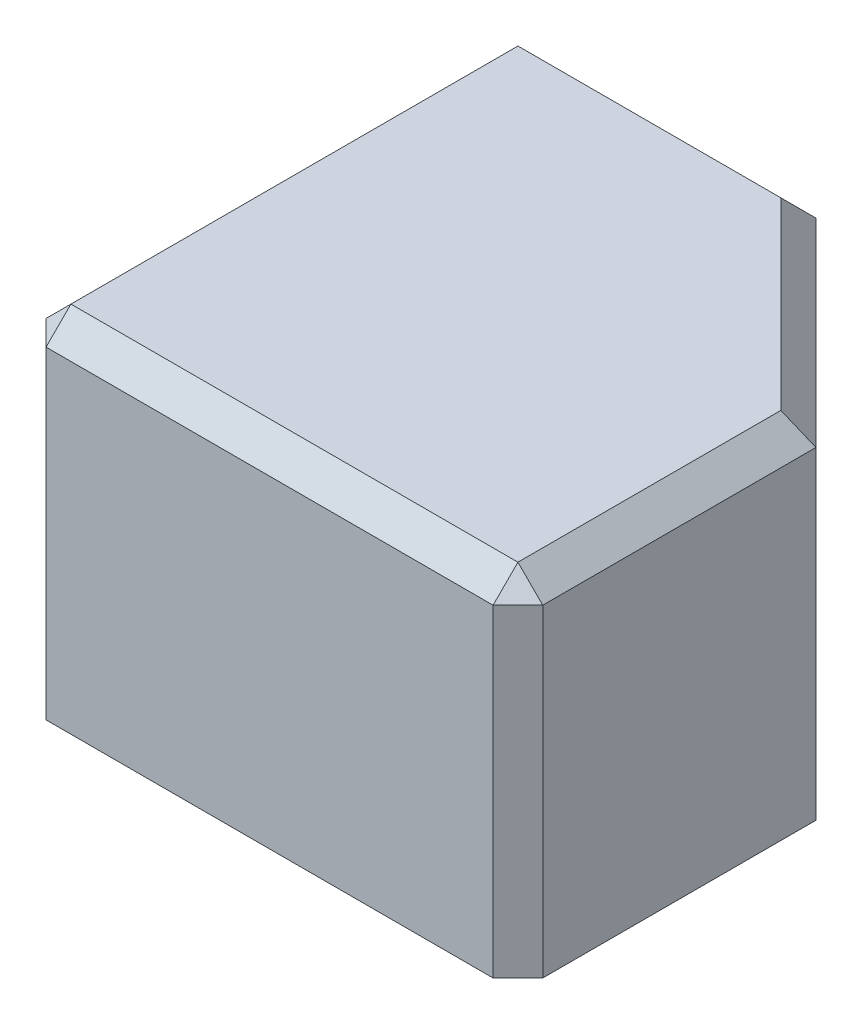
ISO-10303-21;
HEADER;
FILE_DESCRIPTION(('STEP AP214'),'2;1');
FILE_NAME('part.step','',(''),(''),'','','');
FILE_SCHEMA(('AUTOMOTIVE_DESIGN { 1 0 10303 214 1 1 1 1 }'));
ENDSEC;
DATA;
#1=APPLICATION_CONTEXT('core data for automotive mechanical design processes');
#2=APPLICATION_PROTOCOL_DEFINITION('international standard','automotive_design',2000,#1);
#3=PRODUCT_CONTEXT('',#1,'mechanical');
#4=PRODUCT('Part','Part','',(#3));
#5=PRODUCT_RELATED_PRODUCT_CATEGORY('part','',(#4));
#6=PRODUCT_DEFINITION_FORMATION('','',#4);
#7=PRODUCT_DEFINITION_CONTEXT('part definition',#1,'design');
#8=PRODUCT_DEFINITION('design','',#6,#7);
#9=PRODUCT_DEFINITION_SHAPE('','',#8);
#10=(LENGTH_UNIT() NAMED_UNIT(*) SI_UNIT(.MILLI.,.METRE.));
#11=(NAMED_UNIT(*) PLANE_ANGLE_UNIT() SI_UNIT($,.RADIAN.));
#12=(NAMED_UNIT(*) SI_UNIT($,.STERADIAN.) SOLID_ANGLE_UNIT());
#13=UNCERTAINTY_MEASURE_WITH_UNIT(LENGTH_MEASURE(1.E-05),#10,'distance_accuracy_value','');
#14=(GEOMETRIC_REPRESENTATION_CONTEXT(3) GLOBAL_UNCERTAINTY_ASSIGNED_CONTEXT((#13)) GLOBAL_UNIT_ASSIGNED_CONTEXT((#10,
#11,#12)) REPRESENTATION_CONTEXT('',''));
#15=CARTESIAN_POINT('',(0.,0.,0.));
#16=DIRECTION('',(0.,0.,1.));
#17=DIRECTION('',(1.,0.,0.));
#18=AXIS2_PLACEMENT_3D('',#15,#16,#17);
#19=CARTESIAN_POINT('',(10.,7.,0.));
#20=DIRECTION('',(0.,0.,-1.));
#21=DIRECTION('',(-1.,0.,0.));
#22=AXIS2_PLACEMENT_3D('',#19,#20,#21);
#23=PLANE('',#22);
#24=DIRECTION('',(1.,0.,0.));
#25=VECTOR('',#24,1.);
#26=CARTESIAN_POINT('',(10.,0.,0.));
#27=LINE('',#26,#25);
#28=CARTESIAN_POINT('',(0.5,0.,0.));
#29=VERTEX_POINT('',#28);
#30=CARTESIAN_POINT('',(9.5,0.,0.));
#31=VERTEX_POINT('',#30);
#32=EDGE_CURVE('E184',#29,#31,#27,.T.);
#33=ORIENTED_EDGE('',*,*,#32,.T.);
#34=DIRECTION('',(0.,1.,0.));
#35=VECTOR('',#34,1.);
#36=CARTESIAN_POINT('',(9.5,7.,0.));
#37=LINE('',#36,#35);
#38=CARTESIAN_POINT('',(9.5,6.5,0.));
#39=VERTEX_POINT('',#38);
#40=EDGE_CURVE('E383',#31,#39,#37,.T.);
#41=ORIENTED_EDGE('',*,*,#40,.T.);
#42=DIRECTION('',(-1.,0.,0.));
#43=VECTOR('',#42,1.);
#44=CARTESIAN_POINT('',(10.,6.5,0.));
#45=LINE('',#44,#43);
#46=CARTESIAN_POINT('',(0.5,6.5,0.));
#47=VERTEX_POINT('',#46);
#48=EDGE_CURVE('E381',#39,#47,#45,.T.);
#49=ORIENTED_EDGE('',*,*,#48,.T.);
#50=DIRECTION('',(0.,-1.,0.));
#51=VECTOR('',#50,1.);
#52=CARTESIAN_POINT('',(0.5,7.,0.));
#53=LINE('',#52,#51);
#54=EDGE_CURVE('E379',#47,#29,#53,.T.);
#55=ORIENTED_EDGE('',*,*,#54,.T.);
#56=EDGE_LOOP('',(#33,#41,#49,#55));
#57=FACE_BOUND('',#56,.T.);
#58=ADVANCED_FACE('F36',(#57),#23,.F.);
#59=CARTESIAN_POINT('',(10.,7.,-6.));
#60=DIRECTION('',(-1.,0.,0.));
#61=DIRECTION('',(0.,0.,1.));
#62=AXIS2_PLACEMENT_3D('',#59,#60,#61);
#63=PLANE('',#62);
#64=DIRECTION('',(0.,0.,1.));
#65=VECTOR('',#64,1.);
#66=CARTESIAN_POINT('',(10.,6.5,-6.));
#67=LINE('',#66,#65);
#68=CARTESIAN_POINT('',(10.,6.5,-6.));
#69=VERTEX_POINT('',#68);
#70=CARTESIAN_POINT('',(10.,6.5,-0.500000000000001));
#71=VERTEX_POINT('',#70);
#72=EDGE_CURVE('E352',#69,#71,#67,.T.);
#73=ORIENTED_EDGE('',*,*,#72,.T.);
#74=DIRECTION('',(0.,-1.,0.));
#75=VECTOR('',#74,1.);
#76=CARTESIAN_POINT('',(10.,7.,-0.500000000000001));
#77=LINE('',#76,#75);
#78=CARTESIAN_POINT('',(10.,0.,-0.500000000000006));
#79=VERTEX_POINT('',#78);
#80=EDGE_CURVE('E357',#71,#79,#77,.T.);
#81=ORIENTED_EDGE('',*,*,#80,.T.);
#82=DIRECTION('',(0.,0.,-1.));
#83=VECTOR('',#82,1.);
#84=CARTESIAN_POINT('',(10.,0.,-6.));
#85=LINE('',#84,#83);
#86=CARTESIAN_POINT('',(10.,0.,-6.));
#87=VERTEX_POINT('',#86);
#88=EDGE_CURVE('E187',#79,#87,#85,.T.);
#89=ORIENTED_EDGE('',*,*,#88,.T.);
#90=DIRECTION('',(0.,-1.,0.));
#91=VECTOR('',#90,1.);
#92=CARTESIAN_POINT('',(10.,7.,-6.));
#93=LINE('',#92,#91);
#94=EDGE_CURVE('E201',#69,#87,#93,.T.);
#95=ORIENTED_EDGE('',*,*,#94,.F.);
#96=EDGE_LOOP('',(#73,#81,#89,#95));
#97=FACE_BOUND('',#96,.T.);
#98=ADVANCED_FACE('F238',(#97),#63,.F.);
#99=CARTESIAN_POINT('',(6.,7.,-10.));
#100=DIRECTION('',(-0.707106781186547,0.,0.707106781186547));
#101=DIRECTION('',(0.707106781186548,0.,0.707106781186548));
#102=AXIS2_PLACEMENT_3D('',#99,#100,#101);
#103=PLANE('',#102);
#104=CARTESIAN_POINT('',(8.,5.,-8.00000000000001));
#105=DIRECTION('',(0.707106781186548,0.,-0.707106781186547));
#106=DIRECTION('',(-0.707106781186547,0.,-0.707106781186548));
#107=AXIS2_PLACEMENT_3D('',#104,#105,#106);
#108=CIRCLE('',#107,0.824999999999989);
#109=CARTESIAN_POINT('',(7.41663690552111,5.,-8.5833630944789));
#110=VERTEX_POINT('',#109);
#111=EDGE_CURVE('E168',#110,#110,#108,.T.);
#112=ORIENTED_EDGE('',*,*,#111,.F.);
#113=EDGE_LOOP('',(#112));
#114=FACE_BOUND('',#113,.T.);
#115=DIRECTION('',(0.,-1.,0.));
#116=VECTOR('',#115,1.);
#117=CARTESIAN_POINT('',(6.,7.,-10.));
#118=LINE('',#117,#116);
#119=CARTESIAN_POINT('',(6.,6.5,-10.));
#120=VERTEX_POINT('',#119);
#121=CARTESIAN_POINT('',(6.,0.,-10.));
#122=VERTEX_POINT('',#121);
#123=EDGE_CURVE('E199',#120,#122,#118,.T.);
#124=ORIENTED_EDGE('',*,*,#123,.F.);
#125=DIRECTION('',(0.707106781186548,0.,0.707106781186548));
#126=VECTOR('',#125,1.);
#127=CARTESIAN_POINT('',(6.,6.5,-10.));
#128=LINE('',#127,#126);
#129=EDGE_CURVE('E11',#120,#69,#128,.T.);
#130=ORIENTED_EDGE('',*,*,#129,.T.);
#131=ORIENTED_EDGE('',*,*,#94,.T.);
#132=DIRECTION('',(-0.707106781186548,0.,-0.707106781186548));
#133=VECTOR('',#132,1.);
#134=CARTESIAN_POINT('',(6.,0.,-10.));
#135=LINE('',#134,#133);
#136=EDGE_CURVE('E190',#87,#122,#135,.T.);
#137=ORIENTED_EDGE('',*,*,#136,.T.);
#138=EDGE_LOOP('',(#124,#130,#131,#137));
#139=FACE_BOUND('',#138,.T.);
#140=ADVANCED_FACE('F244',(#114,#139),#103,.F.);
#141=CARTESIAN_POINT('',(0.,7.,-10.));
#142=DIRECTION('',(0.,0.,1.));
#143=DIRECTION('',(1.,0.,0.));
#144=AXIS2_PLACEMENT_3D('',#141,#142,#143);
#145=PLANE('',#144);
#146=CARTESIAN_POINT('',(3.,5.,-10.));
#147=DIRECTION('',(0.,0.,-1.));
#148=DIRECTION('',(-1.,0.,0.));
#149=AXIS2_PLACEMENT_3D('',#146,#147,#148);
#150=CIRCLE('',#149,0.824999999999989);
#151=CARTESIAN_POINT('',(2.17500000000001,5.,-10.));
#152=VERTEX_POINT('',#151);
#153=EDGE_CURVE('E178',#152,#152,#150,.T.);
#154=ORIENTED_EDGE('',*,*,#153,.F.);
#155=EDGE_LOOP('',(#154));
#156=FACE_BOUND('',#155,.T.);
#157=DIRECTION('',(-1.,0.,0.));
#158=VECTOR('',#157,1.);
#159=CARTESIAN_POINT('',(0.,0.,-10.));
#160=LINE('',#159,#158);
#161=CARTESIAN_POINT('',(0.5,0.,-10.));
#162=VERTEX_POINT('',#161);
#163=EDGE_CURVE('E193',#122,#162,#160,.T.);
#164=ORIENTED_EDGE('',*,*,#163,.T.);
#165=DIRECTION('',(0.,1.,0.));
#166=VECTOR('',#165,1.);
#167=CARTESIAN_POINT('',(0.5,7.,-10.));
#168=LINE('',#167,#166);
#169=CARTESIAN_POINT('',(0.5,6.5,-10.));
#170=VERTEX_POINT('',#169);
#171=EDGE_CURVE('E309',#162,#170,#168,.T.);
#172=ORIENTED_EDGE('',*,*,#171,.T.);
#173=DIRECTION('',(1.,0.,0.));
#174=VECTOR('',#173,1.);
#175=CARTESIAN_POINT('',(0.,6.5,-10.));
#176=LINE('',#175,#174);
#177=EDGE_CURVE('E303',#170,#120,#176,.T.);
#178=ORIENTED_EDGE('',*,*,#177,.T.);
#179=ORIENTED_EDGE('',*,*,#123,.T.);
#180=EDGE_LOOP('',(#164,#172,#178,#179));
#181=FACE_BOUND('',#180,.T.);
#182=ADVANCED_FACE('F364',(#156,#181),#145,.F.);
#183=CARTESIAN_POINT('',(0.,7.,0.));
#184=DIRECTION('',(1.,0.,0.));
#185=DIRECTION('',(0.,0.,-1.));
#186=AXIS2_PLACEMENT_3D('',#183,#184,#185);
#187=PLANE('',#186);
#188=DIRECTION('',(0.,0.,-1.));
#189=VECTOR('',#188,1.);
#190=CARTESIAN_POINT('',(0.,6.5,0.));
#191=LINE('',#190,#189);
#192=CARTESIAN_POINT('',(0.,6.5,-0.500000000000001));
#193=VERTEX_POINT('',#192);
#194=CARTESIAN_POINT('',(0.,6.5,-9.5));
#195=VERTEX_POINT('',#194);
#196=EDGE_CURVE('E314',#193,#195,#191,.T.);
#197=ORIENTED_EDGE('',*,*,#196,.T.);
#198=DIRECTION('',(0.,-1.,0.));
#199=VECTOR('',#198,1.);
#200=CARTESIAN_POINT('',(0.,7.,-9.5));
#201=LINE('',#200,#199);
#202=CARTESIAN_POINT('',(0.,0.,-9.5));
#203=VERTEX_POINT('',#202);
#204=EDGE_CURVE('E310',#195,#203,#201,.T.);
#205=ORIENTED_EDGE('',*,*,#204,.T.);
#206=DIRECTION('',(0.,0.,1.));
#207=VECTOR('',#206,1.);
#208=CARTESIAN_POINT('',(0.,0.,0.));
#209=LINE('',#208,#207);
#210=CARTESIAN_POINT('',(0.,0.,-0.500000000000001));
#211=VERTEX_POINT('',#210);
#212=EDGE_CURVE('E196',#203,#211,#209,.T.);
#213=ORIENTED_EDGE('',*,*,#212,.T.);
#214=DIRECTION('',(0.,1.,0.));
#215=VECTOR('',#214,1.);
#216=CARTESIAN_POINT('',(0.,7.,-0.500000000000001));
#217=LINE('',#216,#215);
#218=EDGE_CURVE('E385',#211,#193,#217,.T.);
#219=ORIENTED_EDGE('',*,*,#218,.T.);
#220=EDGE_LOOP('',(#197,#205,#213,#219));
#221=FACE_BOUND('',#220,.T.);
#222=ADVANCED_FACE('F367',(#221),#187,.F.);
#223=CARTESIAN_POINT('',(0.,7.,0.));
#224=DIRECTION('',(0.,-1.,0.));
#225=DIRECTION('',(0.,0.,-1.));
#226=AXIS2_PLACEMENT_3D('',#223,#224,#225);
#227=PLANE('',#226);
#228=DIRECTION('',(1.,0.,0.));
#229=VECTOR('',#228,1.);
#230=CARTESIAN_POINT('',(0.,7.,-0.5));
#231=LINE('',#230,#229);
#232=CARTESIAN_POINT('',(0.5,7.,-0.500000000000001));
#233=VERTEX_POINT('',#232);
#234=CARTESIAN_POINT('',(9.5,7.,-0.500000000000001));
#235=VERTEX_POINT('',#234);
#236=EDGE_CURVE('E319',#233,#235,#231,.T.);
#237=ORIENTED_EDGE('',*,*,#236,.T.);
#238=DIRECTION('',(0.,0.,-1.));
#239=VECTOR('',#238,1.);
#240=CARTESIAN_POINT('',(9.5,7.,0.));
#241=LINE('',#240,#239);
#242=CARTESIAN_POINT('',(9.5,7.,-5.79289321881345));
#243=VERTEX_POINT('',#242);
#244=EDGE_CURVE('E45',#235,#243,#241,.T.);
#245=ORIENTED_EDGE('',*,*,#244,.T.);
#246=DIRECTION('',(-0.707106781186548,0.,-0.707106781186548));
#247=VECTOR('',#246,1.);
#248=CARTESIAN_POINT('',(7.64644660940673,7.,-7.64644660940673));
#249=LINE('',#248,#247);
#250=CARTESIAN_POINT('',(5.79289321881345,7.,-9.5));
#251=VERTEX_POINT('',#250);
#252=EDGE_CURVE('E60',#243,#251,#249,.T.);
#253=ORIENTED_EDGE('',*,*,#252,.T.);
#254=DIRECTION('',(-1.,0.,0.));
#255=VECTOR('',#254,1.);
#256=CARTESIAN_POINT('',(0.,7.,-9.5));
#257=LINE('',#256,#255);
#258=CARTESIAN_POINT('',(0.5,7.,-9.5));
#259=VERTEX_POINT('',#258);
#260=EDGE_CURVE('E321',#251,#259,#257,.T.);
#261=ORIENTED_EDGE('',*,*,#260,.T.);
#262=DIRECTION('',(0.,0.,1.));
#263=VECTOR('',#262,1.);
#264=CARTESIAN_POINT('',(0.5,7.,0.));
#265=LINE('',#264,#263);
#266=EDGE_CURVE('E312',#259,#233,#265,.T.);
#267=ORIENTED_EDGE('',*,*,#266,.T.);
#268=EDGE_LOOP('',(#237,#245,#253,#261,#267));
#269=FACE_BOUND('',#268,.T.);
#270=ADVANCED_FACE('F347',(#269),#227,.F.);
#271=CARTESIAN_POINT('',(0.,0.,0.));
#272=DIRECTION('',(0.,-1.,0.));
#273=DIRECTION('',(0.,0.,-1.));
#274=AXIS2_PLACEMENT_3D('',#271,#272,#273);
#275=PLANE('',#274);
#276=CARTESIAN_POINT('',(5.1,0.,-8.));
#277=DIRECTION('',(0.,-1.,0.));
#278=DIRECTION('',(0.,0.,-1.));
#279=AXIS2_PLACEMENT_3D('',#276,#277,#278);
#280=CIRCLE('',#279,0.625);
#281=CARTESIAN_POINT('',(5.1,0.,-8.625));
#282=VERTEX_POINT('',#281);
#283=EDGE_CURVE('E152',#282,#282,#280,.T.);
#284=ORIENTED_EDGE('',*,*,#283,.F.);
#285=EDGE_LOOP('',(#284));
#286=FACE_BOUND('',#285,.T.);
#287=CARTESIAN_POINT('',(8.,0.,-5.1));
#288=DIRECTION('',(0.,-1.,0.));
#289=DIRECTION('',(0.,0.,-1.));
#290=AXIS2_PLACEMENT_3D('',#287,#288,#289);
#291=CIRCLE('',#290,0.624999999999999);
#292=CARTESIAN_POINT('',(8.,0.,-5.725));
#293=VERTEX_POINT('',#292);
#294=EDGE_CURVE('E151',#293,#293,#291,.T.);
#295=ORIENTED_EDGE('',*,*,#294,.F.);
#296=EDGE_LOOP('',(#295));
#297=FACE_BOUND('',#296,.T.);
#298=CARTESIAN_POINT('',(2.,0.,-2.));
#299=DIRECTION('',(0.,-1.,0.));
#300=DIRECTION('',(0.,0.,-1.));
#301=AXIS2_PLACEMENT_3D('',#298,#299,#300);
#302=CIRCLE('',#301,0.625);
#303=CARTESIAN_POINT('',(2.,0.,-2.625));
#304=VERTEX_POINT('',#303);
#305=EDGE_CURVE('E162',#304,#304,#302,.T.);
#306=ORIENTED_EDGE('',*,*,#305,.F.);
#307=EDGE_LOOP('',(#306));
#308=FACE_BOUND('',#307,.T.);
#309=ORIENTED_EDGE('',*,*,#88,.F.);
#310=DIRECTION('',(0.707106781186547,0.,-0.707106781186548));
#311=VECTOR('',#310,1.);
#312=CARTESIAN_POINT('',(4.75,0.,4.75));
#313=LINE('',#312,#311);
#314=EDGE_CURVE('E374',#79,#31,#313,.F.);
#315=ORIENTED_EDGE('',*,*,#314,.T.);
#316=ORIENTED_EDGE('',*,*,#32,.F.);
#317=DIRECTION('',(0.707106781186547,0.,0.707106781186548));
#318=VECTOR('',#317,1.);
#319=CARTESIAN_POINT('',(0.25,0.,-0.25));
#320=LINE('',#319,#318);
#321=EDGE_CURVE('E371',#29,#211,#320,.F.);
#322=ORIENTED_EDGE('',*,*,#321,.T.);
#323=ORIENTED_EDGE('',*,*,#212,.F.);
#324=DIRECTION('',(-0.707106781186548,0.,0.707106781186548));
#325=VECTOR('',#324,1.);
#326=CARTESIAN_POINT('',(-4.75,0.,-4.75));
#327=LINE('',#326,#325);
#328=EDGE_CURVE('E362',#203,#162,#327,.F.);
#329=ORIENTED_EDGE('',*,*,#328,.T.);
#330=ORIENTED_EDGE('',*,*,#163,.F.);
#331=ORIENTED_EDGE('',*,*,#136,.F.);
#332=EDGE_LOOP('',(#309,#315,#316,#322,#323,#329,#330,#331));
#333=FACE_BOUND('',#332,.T.);
#334=ADVANCED_FACE('F233',(#286,#297,#308,#333),#275,.T.);
#335=CARTESIAN_POINT('',(3.,5.,-3.));
#336=DIRECTION('',(0.,0.,-1.));
#337=DIRECTION('',(-1.,0.,0.));
#338=AXIS2_PLACEMENT_3D('',#335,#336,#337);
#339=CONICAL_SURFACE('',#338,0.824999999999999,0.785398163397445);
#340=CARTESIAN_POINT('',(3.,5.,-2.175));
#341=VERTEX_POINT('',#340);
#342=VERTEX_LOOP('',#341);
#343=FACE_BOUND('',#342,.T.);
#344=CARTESIAN_POINT('',(3.,5.,-3.));
#345=DIRECTION('',(0.,0.,-1.));
#346=DIRECTION('',(-1.,0.,0.));
#347=AXIS2_PLACEMENT_3D('',#344,#345,#346);
#348=CIRCLE('',#347,0.824999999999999);
#349=CARTESIAN_POINT('',(3.80761184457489,4.83151228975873,-3.));
#350=VERTEX_POINT('',#349);
#351=CARTESIAN_POINT('',(3.80761184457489,5.16848771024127,-3.));
#352=VERTEX_POINT('',#351);
#353=EDGE_CURVE('E181',#350,#352,#348,.T.);
#354=ORIENTED_EDGE('',*,*,#353,.T.);
#355=CARTESIAN_POINT('',(3.80741184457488,5.17041465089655,-3.00020000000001));
#356=CARTESIAN_POINT('',(3.81334122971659,5.11360976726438,-2.9942706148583));
#357=CARTESIAN_POINT('',(3.81630592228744,5.0568048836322,-2.99130592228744));
#358=CARTESIAN_POINT('',(3.81630592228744,4.94319511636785,-2.99130592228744));
#359=CARTESIAN_POINT('',(3.81334122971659,4.88639023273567,-2.9942706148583));
#360=CARTESIAN_POINT('',(3.80741184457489,4.8295853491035,-3.0002));
#361=B_SPLINE_CURVE_WITH_KNOTS('',3,(#355,#356,#357,#358,#359,#360),.UNSPECIFIED.,.F.,.F.,(4,2,
4),(0.,0.170878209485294,0.341756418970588),.UNSPECIFIED.);
#362=EDGE_CURVE('E203',#352,#350,#361,.T.);
#363=ORIENTED_EDGE('',*,*,#362,.T.);
#364=EDGE_LOOP('',(#354,#363));
#365=FACE_BOUND('',#364,.T.);
#366=ADVANCED_FACE('F213',(#343,#365),#339,.F.);
#367=CARTESIAN_POINT('',(3.,5.,-10.));
#368=DIRECTION('',(0.,0.,-1.));
#369=DIRECTION('',(-1.,0.,0.));
#370=AXIS2_PLACEMENT_3D('',#367,#368,#369);
#371=CYLINDRICAL_SURFACE('',#370,0.824999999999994);
#372=CARTESIAN_POINT('',(3.,5.,-3.));
#373=DIRECTION('',(-0.923879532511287,0.,-0.38268343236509));
#374=DIRECTION('',(0.38268343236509,0.,-0.923879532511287));
#375=AXIS2_PLACEMENT_3D('',#372,#373,#374);
#376=ELLIPSE('',#375,2.155828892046,0.824999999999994);
#377=CARTESIAN_POINT('',(3.23654403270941,4.20963810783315,-3.57106781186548));
#378=VERTEX_POINT('',#377);
#379=CARTESIAN_POINT('',(3.23654403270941,5.79036189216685,-3.57106781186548));
#380=VERTEX_POINT('',#379);
#381=EDGE_CURVE('E211',#378,#380,#376,.F.);
#382=ORIENTED_EDGE('',*,*,#381,.T.);
#383=CARTESIAN_POINT('',(3.,5.,-3.80761184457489));
#384=DIRECTION('',(-0.707106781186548,0.,0.707106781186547));
#385=DIRECTION('',(-0.707106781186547,0.,-0.707106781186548));
#386=AXIS2_PLACEMENT_3D('',#383,#384,#385);
#387=ELLIPSE('',#386,1.16672618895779,0.824999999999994);
#388=EDGE_CURVE('E177',#380,#352,#387,.F.);
#389=ORIENTED_EDGE('',*,*,#388,.T.);
#390=ORIENTED_EDGE('',*,*,#353,.F.);
#391=EDGE_CURVE('E174',#350,#378,#387,.F.);
#392=ORIENTED_EDGE('',*,*,#391,.T.);
#393=EDGE_LOOP('',(#382,#389,#390,#392));
#394=FACE_BOUND('',#393,.T.);
#395=ORIENTED_EDGE('',*,*,#153,.T.);
#396=EDGE_LOOP('',(#395));
#397=FACE_BOUND('',#396,.T.);
#398=ADVANCED_FACE('F225',(#394,#397),#371,.F.);
#399=CARTESIAN_POINT('',(8.,5.,-8.));
#400=DIRECTION('',(0.707106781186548,0.,-0.707106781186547));
#401=DIRECTION('',(-0.707106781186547,0.,-0.707106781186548));
#402=AXIS2_PLACEMENT_3D('',#399,#400,#401);
#403=CYLINDRICAL_SURFACE('',#402,0.824999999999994);
#404=ORIENTED_EDGE('',*,*,#111,.T.);
#405=EDGE_LOOP('',(#404));
#406=FACE_BOUND('',#405,.T.);
#407=CARTESIAN_POINT('',(3.40380592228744,5.,-3.40380592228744));
#408=DIRECTION('',(0.707106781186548,0.,-0.707106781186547));
#409=DIRECTION('',(-0.707106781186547,0.,-0.707106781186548));
#410=AXIS2_PLACEMENT_3D('',#407,#408,#409);
#411=CIRCLE('',#410,0.824999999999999);
#412=EDGE_CURVE('E171',#380,#378,#411,.T.);
#413=ORIENTED_EDGE('',*,*,#412,.F.);
#414=ORIENTED_EDGE('',*,*,#381,.F.);
#415=EDGE_LOOP('',(#413,#414));
#416=FACE_BOUND('',#415,.T.);
#417=ADVANCED_FACE('F222',(#406,#416),#403,.F.);
#418=CARTESIAN_POINT('',(3.40380592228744,5.,-3.40380592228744));
#419=DIRECTION('',(-0.707106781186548,0.,0.707106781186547));
#420=DIRECTION('',(0.707106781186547,0.,0.707106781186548));
#421=AXIS2_PLACEMENT_3D('',#418,#419,#420);
#422=PLANE('',#421);
#423=ORIENTED_EDGE('',*,*,#412,.T.);
#424=ORIENTED_EDGE('',*,*,#391,.F.);
#425=ORIENTED_EDGE('',*,*,#362,.F.);
#426=ORIENTED_EDGE('',*,*,#388,.F.);
#427=EDGE_LOOP('',(#423,#424,#425,#426));
#428=FACE_BOUND('',#427,.T.);
#429=ADVANCED_FACE('F217',(#428),#422,.F.);
#430=CARTESIAN_POINT('',(2.,3.5,-2.));
#431=DIRECTION('',(0.,-1.,0.));
#432=DIRECTION('',(0.,0.,-1.));
#433=AXIS2_PLACEMENT_3D('',#430,#431,#432);
#434=CONICAL_SURFACE('',#433,0.624999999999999,1.02974425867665);
#435=CARTESIAN_POINT('',(2.,3.87553788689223,-2.));
#436=VERTEX_POINT('',#435);
#437=VERTEX_LOOP('',#436);
#438=FACE_BOUND('',#437,.T.);
#439=CARTESIAN_POINT('',(2.,3.5,-2.));
#440=DIRECTION('',(0.,-1.,0.));
#441=DIRECTION('',(0.,0.,-1.));
#442=AXIS2_PLACEMENT_3D('',#439,#440,#441);
#443=CIRCLE('',#442,0.624999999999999);
#444=CARTESIAN_POINT('',(2.,3.5,-2.625));
#445=VERTEX_POINT('',#444);
#446=EDGE_CURVE('E165',#445,#445,#443,.T.);
#447=ORIENTED_EDGE('',*,*,#446,.T.);
#448=EDGE_LOOP('',(#447));
#449=FACE_BOUND('',#448,.T.);
#450=ADVANCED_FACE('F221',(#438,#449),#434,.F.);
#451=CARTESIAN_POINT('',(2.,0.,-2.));
#452=DIRECTION('',(0.,-1.,0.));
#453=DIRECTION('',(0.,0.,-1.));
#454=AXIS2_PLACEMENT_3D('',#451,#452,#453);
#455=CYLINDRICAL_SURFACE('',#454,0.624999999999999);
#456=ORIENTED_EDGE('',*,*,#446,.F.);
#457=EDGE_LOOP('',(#456));
#458=FACE_BOUND('',#457,.T.);
#459=ORIENTED_EDGE('',*,*,#305,.T.);
#460=EDGE_LOOP('',(#459));
#461=FACE_BOUND('',#460,.T.);
#462=ADVANCED_FACE('F528',(#458,#461),#455,.F.);
#463=CARTESIAN_POINT('',(8.,3.5,-5.1));
#464=DIRECTION('',(0.,-1.,0.));
#465=DIRECTION('',(0.,0.,-1.));
#466=AXIS2_PLACEMENT_3D('',#463,#464,#465);
#467=CONICAL_SURFACE('',#466,0.624999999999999,1.02974425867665);
#468=CARTESIAN_POINT('',(8.,3.87553788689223,-5.1));
#469=VERTEX_POINT('',#468);
#470=VERTEX_LOOP('',#469);
#471=FACE_BOUND('',#470,.T.);
#472=CARTESIAN_POINT('',(8.,3.5,-5.1));
#473=DIRECTION('',(0.,-1.,0.));
#474=DIRECTION('',(0.,0.,-1.));
#475=AXIS2_PLACEMENT_3D('',#472,#473,#474);
#476=CIRCLE('',#475,0.624999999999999);
#477=CARTESIAN_POINT('',(8.,3.5,-5.725));
#478=VERTEX_POINT('',#477);
#479=EDGE_CURVE('E155',#478,#478,#476,.T.);
#480=ORIENTED_EDGE('',*,*,#479,.T.);
#481=EDGE_LOOP('',(#480));
#482=FACE_BOUND('',#481,.T.);
#483=ADVANCED_FACE('F520',(#471,#482),#467,.F.);
#484=CARTESIAN_POINT('',(8.,0.,-5.1));
#485=DIRECTION('',(0.,-1.,0.));
#486=DIRECTION('',(0.,0.,-1.));
#487=AXIS2_PLACEMENT_3D('',#484,#485,#486);
#488=CYLINDRICAL_SURFACE('',#487,0.624999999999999);
#489=ORIENTED_EDGE('',*,*,#479,.F.);
#490=EDGE_LOOP('',(#489));
#491=FACE_BOUND('',#490,.T.);
#492=ORIENTED_EDGE('',*,*,#294,.T.);
#493=EDGE_LOOP('',(#492));
#494=FACE_BOUND('',#493,.T.);
#495=ADVANCED_FACE('F145',(#491,#494),#488,.F.);
#496=CARTESIAN_POINT('',(5.1,3.5,-8.));
#497=DIRECTION('',(0.,-1.,0.));
#498=DIRECTION('',(0.,0.,-1.));
#499=AXIS2_PLACEMENT_3D('',#496,#497,#498);
#500=CONICAL_SURFACE('',#499,0.624999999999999,1.02974425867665);
#501=CARTESIAN_POINT('',(5.1,3.87553788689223,-8.));
#502=VERTEX_POINT('',#501);
#503=VERTEX_LOOP('',#502);
#504=FACE_BOUND('',#503,.T.);
#505=CARTESIAN_POINT('',(5.1,3.5,-8.));
#506=DIRECTION('',(0.,-1.,0.));
#507=DIRECTION('',(0.,0.,-1.));
#508=AXIS2_PLACEMENT_3D('',#505,#506,#507);
#509=CIRCLE('',#508,0.624999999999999);
#510=CARTESIAN_POINT('',(5.1,3.5,-8.625));
#511=VERTEX_POINT('',#510);
#512=EDGE_CURVE('E149',#511,#511,#509,.T.);
#513=ORIENTED_EDGE('',*,*,#512,.T.);
#514=EDGE_LOOP('',(#513));
#515=FACE_BOUND('',#514,.T.);
#516=ADVANCED_FACE('F141',(#504,#515),#500,.F.);
#517=CARTESIAN_POINT('',(5.1,0.,-8.));
#518=DIRECTION('',(0.,-1.,0.));
#519=DIRECTION('',(0.,0.,-1.));
#520=AXIS2_PLACEMENT_3D('',#517,#518,#519);
#521=CYLINDRICAL_SURFACE('',#520,0.624999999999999);
#522=ORIENTED_EDGE('',*,*,#512,.F.);
#523=EDGE_LOOP('',(#522));
#524=FACE_BOUND('',#523,.T.);
#525=ORIENTED_EDGE('',*,*,#283,.T.);
#526=EDGE_LOOP('',(#525));
#527=FACE_BOUND('',#526,.T.);
#528=ADVANCED_FACE('F144',(#524,#527),#521,.F.);
#529=CARTESIAN_POINT('',(0.,7.,-9.5));
#530=DIRECTION('',(0.707106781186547,0.,0.707106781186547));
#531=DIRECTION('',(0.,-1.,0.));
#532=AXIS2_PLACEMENT_3D('',#529,#530,#531);
#533=PLANE('',#532);
#534=DIRECTION('',(0.707106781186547,0.,-0.707106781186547));
#535=VECTOR('',#534,1.);
#536=CARTESIAN_POINT('',(0.5,6.5,-10.));
#537=LINE('',#536,#535);
#538=EDGE_CURVE('E40',#170,#195,#537,.F.);
#539=ORIENTED_EDGE('',*,*,#538,.F.);
#540=ORIENTED_EDGE('',*,*,#171,.F.);
#541=ORIENTED_EDGE('',*,*,#328,.F.);
#542=ORIENTED_EDGE('',*,*,#204,.F.);
#543=EDGE_LOOP('',(#539,#540,#541,#542));
#544=FACE_BOUND('',#543,.T.);
#545=ADVANCED_FACE('F38',(#544),#533,.F.);
#546=CARTESIAN_POINT('',(0.5,6.5,-10.));
#547=DIRECTION('',(-0.577350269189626,0.577350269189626,-0.577350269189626));
#548=DIRECTION('',(-0.707106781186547,0.,0.707106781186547));
#549=AXIS2_PLACEMENT_3D('',#546,#547,#548);
#550=PLANE('',#549);
#551=DIRECTION('',(0.,0.707106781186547,0.707106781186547));
#552=VECTOR('',#551,1.);
#553=CARTESIAN_POINT('',(0.5,6.5,-10.));
#554=LINE('',#553,#552);
#555=EDGE_CURVE('E294',#170,#259,#554,.T.);
#556=ORIENTED_EDGE('',*,*,#555,.F.);
#557=ORIENTED_EDGE('',*,*,#538,.T.);
#558=DIRECTION('',(-0.707106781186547,-0.707106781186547,0.));
#559=VECTOR('',#558,1.);
#560=CARTESIAN_POINT('',(0.25,6.75,-9.5));
#561=LINE('',#560,#559);
#562=EDGE_CURVE('E298',#259,#195,#561,.T.);
#563=ORIENTED_EDGE('',*,*,#562,.F.);
#564=EDGE_LOOP('',(#556,#557,#563));
#565=FACE_BOUND('',#564,.T.);
#566=ADVANCED_FACE('F282',(#565),#550,.T.);
#567=CARTESIAN_POINT('',(0.5,7.,0.));
#568=DIRECTION('',(0.707106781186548,0.,-0.707106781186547));
#569=DIRECTION('',(0.,-1.,0.));
#570=AXIS2_PLACEMENT_3D('',#567,#568,#569);
#571=PLANE('',#570);
#572=ORIENTED_EDGE('',*,*,#321,.F.);
#573=ORIENTED_EDGE('',*,*,#54,.F.);
#574=DIRECTION('',(-0.707106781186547,0.,-0.707106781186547));
#575=VECTOR('',#574,1.);
#576=CARTESIAN_POINT('',(0.5,6.5,0.));
#577=LINE('',#576,#575);
#578=EDGE_CURVE('E300',#193,#47,#577,.F.);
#579=ORIENTED_EDGE('',*,*,#578,.F.);
#580=ORIENTED_EDGE('',*,*,#218,.F.);
#581=EDGE_LOOP('',(#572,#573,#579,#580));
#582=FACE_BOUND('',#581,.T.);
#583=ADVANCED_FACE('F279',(#582),#571,.F.);
#584=CARTESIAN_POINT('',(0.5,7.,0.));
#585=DIRECTION('',(0.707106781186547,-0.707106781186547,0.));
#586=DIRECTION('',(0.,0.,1.));
#587=AXIS2_PLACEMENT_3D('',#584,#585,#586);
#588=PLANE('',#587);
#589=ORIENTED_EDGE('',*,*,#562,.T.);
#590=ORIENTED_EDGE('',*,*,#196,.F.);
#591=DIRECTION('',(0.707106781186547,0.707106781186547,0.));
#592=VECTOR('',#591,1.);
#593=CARTESIAN_POINT('',(0.25,6.75,-0.5));
#594=LINE('',#593,#592);
#595=EDGE_CURVE('E339',#233,#193,#594,.F.);
#596=ORIENTED_EDGE('',*,*,#595,.F.);
#597=ORIENTED_EDGE('',*,*,#266,.F.);
#598=EDGE_LOOP('',(#589,#590,#596,#597));
#599=FACE_BOUND('',#598,.T.);
#600=ADVANCED_FACE('F275',(#599),#588,.F.);
#601=CARTESIAN_POINT('',(0.,7.,-9.5));
#602=DIRECTION('',(0.,-0.707106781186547,0.707106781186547));
#603=DIRECTION('',(-1.,0.,0.));
#604=AXIS2_PLACEMENT_3D('',#601,#602,#603);
#605=PLANE('',#604);
#606=ORIENTED_EDGE('',*,*,#555,.T.);
#607=ORIENTED_EDGE('',*,*,#260,.F.);
#608=DIRECTION('',(0.281084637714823,-0.678598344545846,-0.678598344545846));
#609=VECTOR('',#608,1.);
#610=CARTESIAN_POINT('',(5.33520498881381,8.10495713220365,-8.39504286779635));
#611=LINE('',#610,#609);
#612=EDGE_CURVE('E305',#120,#251,#611,.F.);
#613=ORIENTED_EDGE('',*,*,#612,.F.);
#614=ORIENTED_EDGE('',*,*,#177,.F.);
#615=EDGE_LOOP('',(#606,#607,#613,#614));
#616=FACE_BOUND('',#615,.T.);
#617=ADVANCED_FACE('F271',(#616),#605,.F.);
#618=CARTESIAN_POINT('',(0.5,6.5,0.));
#619=DIRECTION('',(-0.577350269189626,0.577350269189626,0.577350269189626));
#620=DIRECTION('',(-0.707106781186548,-0.707106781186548,0.));
#621=AXIS2_PLACEMENT_3D('',#618,#619,#620);
#622=PLANE('',#621);
#623=ORIENTED_EDGE('',*,*,#595,.T.);
#624=ORIENTED_EDGE('',*,*,#578,.T.);
#625=DIRECTION('',(0.,-0.707106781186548,0.707106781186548));
#626=VECTOR('',#625,1.);
#627=CARTESIAN_POINT('',(0.5,6.5,0.));
#628=LINE('',#627,#626);
#629=EDGE_CURVE('E335',#233,#47,#628,.T.);
#630=ORIENTED_EDGE('',*,*,#629,.F.);
#631=EDGE_LOOP('',(#623,#624,#630));
#632=FACE_BOUND('',#631,.T.);
#633=ADVANCED_FACE('F267',(#632),#622,.T.);
#634=CARTESIAN_POINT('',(7.64644660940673,7.,-7.64644660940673));
#635=DIRECTION('',(-0.499999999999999,-0.707106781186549,0.499999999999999));
#636=DIRECTION('',(-0.707106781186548,0.,-0.707106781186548));
#637=AXIS2_PLACEMENT_3D('',#634,#635,#636);
#638=PLANE('',#637);
#639=ORIENTED_EDGE('',*,*,#612,.T.);
#640=ORIENTED_EDGE('',*,*,#252,.F.);
#641=DIRECTION('',(0.678598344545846,-0.678598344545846,-0.281084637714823));
#642=VECTOR('',#641,1.);
#643=CARTESIAN_POINT('',(9.00000000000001,7.5,-5.5857864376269));
#644=LINE('',#643,#642);
#645=EDGE_CURVE('E53',#69,#243,#644,.F.);
#646=ORIENTED_EDGE('',*,*,#645,.F.);
#647=ORIENTED_EDGE('',*,*,#129,.F.);
#648=EDGE_LOOP('',(#639,#640,#646,#647));
#649=FACE_BOUND('',#648,.T.);
#650=ADVANCED_FACE('F263',(#649),#638,.F.);
#651=CARTESIAN_POINT('',(0.,7.,-0.5));
#652=DIRECTION('',(0.,-0.707106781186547,-0.707106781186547));
#653=DIRECTION('',(1.,0.,0.));
#654=AXIS2_PLACEMENT_3D('',#651,#652,#653);
#655=PLANE('',#654);
#656=ORIENTED_EDGE('',*,*,#629,.T.);
#657=ORIENTED_EDGE('',*,*,#48,.F.);
#658=DIRECTION('',(0.,0.707106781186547,-0.707106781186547));
#659=VECTOR('',#658,1.);
#660=CARTESIAN_POINT('',(9.5,6.5,0.));
#661=LINE('',#660,#659);
#662=EDGE_CURVE('E331',#235,#39,#661,.F.);
#663=ORIENTED_EDGE('',*,*,#662,.F.);
#664=ORIENTED_EDGE('',*,*,#236,.F.);
#665=EDGE_LOOP('',(#656,#657,#663,#664));
#666=FACE_BOUND('',#665,.T.);
#667=ADVANCED_FACE('F260',(#666),#655,.F.);
#668=CARTESIAN_POINT('',(9.5,7.,0.));
#669=DIRECTION('',(-0.707106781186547,-0.707106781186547,0.));
#670=DIRECTION('',(0.,0.,-1.));
#671=AXIS2_PLACEMENT_3D('',#668,#669,#670);
#672=PLANE('',#671);
#673=ORIENTED_EDGE('',*,*,#645,.T.);
#674=ORIENTED_EDGE('',*,*,#244,.F.);
#675=DIRECTION('',(0.707106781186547,-0.707106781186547,0.));
#676=VECTOR('',#675,1.);
#677=CARTESIAN_POINT('',(9.75,6.75,-0.500000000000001));
#678=LINE('',#677,#676);
#679=EDGE_CURVE('E328',#71,#235,#678,.F.);
#680=ORIENTED_EDGE('',*,*,#679,.F.);
#681=ORIENTED_EDGE('',*,*,#72,.F.);
#682=EDGE_LOOP('',(#673,#674,#680,#681));
#683=FACE_BOUND('',#682,.T.);
#684=ADVANCED_FACE('F256',(#683),#672,.F.);
#685=CARTESIAN_POINT('',(9.5,6.5,0.));
#686=DIRECTION('',(0.577350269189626,0.577350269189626,0.577350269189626));
#687=DIRECTION('',(-0.707106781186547,0.707106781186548,0.));
#688=AXIS2_PLACEMENT_3D('',#685,#686,#687);
#689=PLANE('',#688);
#690=ORIENTED_EDGE('',*,*,#679,.T.);
#691=ORIENTED_EDGE('',*,*,#662,.T.);
#692=DIRECTION('',(-0.707106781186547,0.,0.707106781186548));
#693=VECTOR('',#692,1.);
#694=CARTESIAN_POINT('',(9.5,6.5,0.));
#695=LINE('',#694,#693);
#696=EDGE_CURVE('E325',#71,#39,#695,.T.);
#697=ORIENTED_EDGE('',*,*,#696,.F.);
#698=EDGE_LOOP('',(#690,#691,#697));
#699=FACE_BOUND('',#698,.T.);
#700=ADVANCED_FACE('F252',(#699),#689,.T.);
#701=CARTESIAN_POINT('',(10.,7.,-0.500000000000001));
#702=DIRECTION('',(-0.707106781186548,0.,-0.707106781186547));
#703=DIRECTION('',(0.,-1.,0.));
#704=AXIS2_PLACEMENT_3D('',#701,#702,#703);
#705=PLANE('',#704);
#706=ORIENTED_EDGE('',*,*,#696,.T.);
#707=ORIENTED_EDGE('',*,*,#40,.F.);
#708=ORIENTED_EDGE('',*,*,#314,.F.);
#709=ORIENTED_EDGE('',*,*,#80,.F.);
#710=EDGE_LOOP('',(#706,#707,#708,#709));
#711=FACE_BOUND('',#710,.T.);
#712=ADVANCED_FACE('F249',(#711),#705,.F.);
#713=CLOSED_SHELL('',(#58,#98,#140,#182,#222,#270,#334,#366,#398,#417,#429,#450,#462,#483,#495,
#516,#528,#545,#566,#583,#600,#617,#633,#650,#667,#684,#700,#712));
#714=MANIFOLD_SOLID_BREP('B2',#713);
#715=ADVANCED_BREP_SHAPE_REPRESENTATION('',(#18,#714),#14);
#716=SHAPE_DEFINITION_REPRESENTATION(#9,#715);
ENDSEC;
END-ISO-10303-21;
